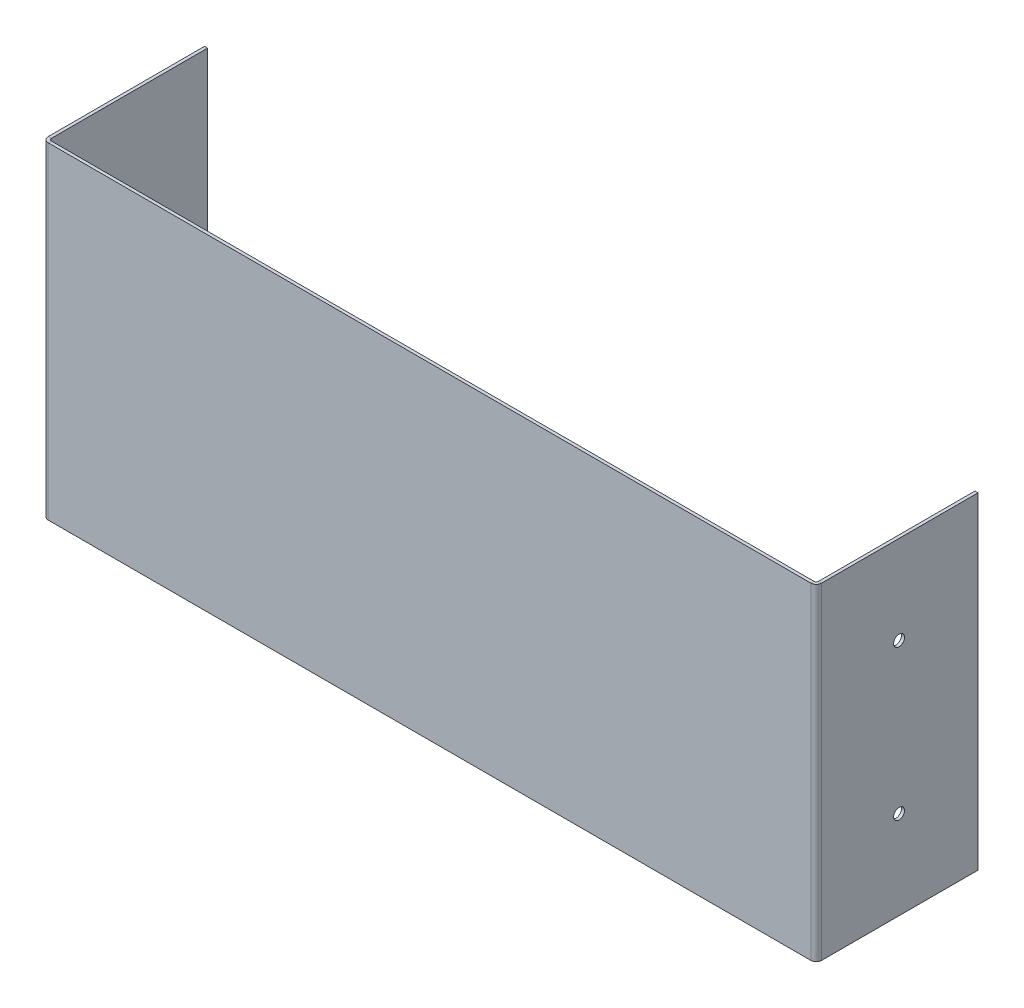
ISO-10303-21;
HEADER;
FILE_DESCRIPTION(('STEP AP214'),'2;1');
FILE_NAME('part.step','',(''),(''),'','','');
FILE_SCHEMA(('AUTOMOTIVE_DESIGN { 1 0 10303 214 1 1 1 1 }'));
ENDSEC;
DATA;
#1=APPLICATION_CONTEXT('core data for automotive mechanical design processes');
#2=APPLICATION_PROTOCOL_DEFINITION('international standard','automotive_design',2000,#1);
#3=PRODUCT_CONTEXT('',#1,'mechanical');
#4=PRODUCT('Part','Part','',(#3));
#5=PRODUCT_RELATED_PRODUCT_CATEGORY('part','',(#4));
#6=PRODUCT_DEFINITION_FORMATION('','',#4);
#7=PRODUCT_DEFINITION_CONTEXT('part definition',#1,'design');
#8=PRODUCT_DEFINITION('design','',#6,#7);
#9=PRODUCT_DEFINITION_SHAPE('','',#8);
#10=(LENGTH_UNIT() NAMED_UNIT(*) SI_UNIT(.MILLI.,.METRE.));
#11=(NAMED_UNIT(*) PLANE_ANGLE_UNIT() SI_UNIT($,.RADIAN.));
#12=(NAMED_UNIT(*) SI_UNIT($,.STERADIAN.) SOLID_ANGLE_UNIT());
#13=UNCERTAINTY_MEASURE_WITH_UNIT(LENGTH_MEASURE(1.E-05),#10,'distance_accuracy_value','');
#14=(GEOMETRIC_REPRESENTATION_CONTEXT(3) GLOBAL_UNCERTAINTY_ASSIGNED_CONTEXT((#13)) GLOBAL_UNIT_ASSIGNED_CONTEXT((#10,
#11,#12)) REPRESENTATION_CONTEXT('',''));
#15=CARTESIAN_POINT('',(0.,0.,0.));
#16=DIRECTION('',(0.,0.,1.));
#17=DIRECTION('',(1.,0.,0.));
#18=AXIS2_PLACEMENT_3D('',#15,#16,#17);
#19=CARTESIAN_POINT('',(-124.4346,-52.578,-0.9906));
#20=DIRECTION('',(0.,0.,1.));
#21=DIRECTION('',(1.,0.,0.));
#22=AXIS2_PLACEMENT_3D('',#19,#20,#21);
#23=PLANE('',#22);
#24=DIRECTION('',(0.,-1.,0.));
#25=VECTOR('',#24,1.);
#26=CARTESIAN_POINT('',(122.7074,-52.578,-0.990600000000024));
#27=LINE('',#26,#25);
#28=CARTESIAN_POINT('',(122.7074,-52.578,-0.990600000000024));
#29=VERTEX_POINT('',#28);
#30=CARTESIAN_POINT('',(122.7074,52.578,-0.990600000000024));
#31=VERTEX_POINT('',#30);
#32=EDGE_CURVE('E217',#29,#31,#27,.F.);
#33=ORIENTED_EDGE('',*,*,#32,.F.);
#34=DIRECTION('',(1.,0.,0.));
#35=VECTOR('',#34,1.);
#36=CARTESIAN_POINT('',(-124.4346,-52.578,-0.9906));
#37=LINE('',#36,#35);
#38=CARTESIAN_POINT('',(-122.7074,-52.578,-0.990599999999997));
#39=VERTEX_POINT('',#38);
#40=EDGE_CURVE('E81',#39,#29,#37,.T.);
#41=ORIENTED_EDGE('',*,*,#40,.F.);
#42=DIRECTION('',(0.,1.,0.));
#43=VECTOR('',#42,1.);
#44=CARTESIAN_POINT('',(-122.7074,52.578,-0.990599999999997));
#45=LINE('',#44,#43);
#46=CARTESIAN_POINT('',(-122.7074,52.578,-0.990599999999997));
#47=VERTEX_POINT('',#46);
#48=EDGE_CURVE('E268',#47,#39,#45,.F.);
#49=ORIENTED_EDGE('',*,*,#48,.F.);
#50=DIRECTION('',(-1.,0.,0.));
#51=VECTOR('',#50,1.);
#52=CARTESIAN_POINT('',(-124.4346,52.578,-0.9906));
#53=LINE('',#52,#51);
#54=EDGE_CURVE('E13',#31,#47,#53,.T.);
#55=ORIENTED_EDGE('',*,*,#54,.F.);
#56=EDGE_LOOP('',(#33,#41,#49,#55));
#57=FACE_BOUND('',#56,.T.);
#58=ADVANCED_FACE('F72',(#57),#23,.F.);
#59=CARTESIAN_POINT('',(-124.4346,-52.578,0.));
#60=DIRECTION('',(0.,0.,1.));
#61=DIRECTION('',(1.,0.,0.));
#62=AXIS2_PLACEMENT_3D('',#59,#60,#61);
#63=PLANE('',#62);
#64=DIRECTION('',(1.,0.,0.));
#65=VECTOR('',#64,1.);
#66=CARTESIAN_POINT('',(-124.4346,-52.578,0.));
#67=LINE('',#66,#65);
#68=CARTESIAN_POINT('',(-122.7074,-52.578,0.));
#69=VERTEX_POINT('',#68);
#70=CARTESIAN_POINT('',(122.7074,-52.578,0.));
#71=VERTEX_POINT('',#70);
#72=EDGE_CURVE('E274',#69,#71,#67,.T.);
#73=ORIENTED_EDGE('',*,*,#72,.T.);
#74=DIRECTION('',(0.,-1.,0.));
#75=VECTOR('',#74,1.);
#76=CARTESIAN_POINT('',(122.7074,-52.578,0.));
#77=LINE('',#76,#75);
#78=CARTESIAN_POINT('',(122.7074,52.578,0.));
#79=VERTEX_POINT('',#78);
#80=EDGE_CURVE('E206',#71,#79,#77,.F.);
#81=ORIENTED_EDGE('',*,*,#80,.T.);
#82=DIRECTION('',(-1.,0.,0.));
#83=VECTOR('',#82,1.);
#84=CARTESIAN_POINT('',(-124.4346,52.578,0.));
#85=LINE('',#84,#83);
#86=CARTESIAN_POINT('',(-122.7074,52.578,0.));
#87=VERTEX_POINT('',#86);
#88=EDGE_CURVE('E76',#79,#87,#85,.T.);
#89=ORIENTED_EDGE('',*,*,#88,.T.);
#90=DIRECTION('',(0.,1.,0.));
#91=VECTOR('',#90,1.);
#92=CARTESIAN_POINT('',(-122.7074,52.578,0.));
#93=LINE('',#92,#91);
#94=EDGE_CURVE('E257',#87,#69,#93,.F.);
#95=ORIENTED_EDGE('',*,*,#94,.T.);
#96=EDGE_LOOP('',(#73,#81,#89,#95));
#97=FACE_BOUND('',#96,.T.);
#98=ADVANCED_FACE('F283',(#97),#63,.T.);
#99=CARTESIAN_POINT('',(-124.4346,-52.578,-0.9906));
#100=DIRECTION('',(0.,-1.,0.));
#101=DIRECTION('',(0.,0.,-1.));
#102=AXIS2_PLACEMENT_3D('',#99,#100,#101);
#103=PLANE('',#102);
#104=ORIENTED_EDGE('',*,*,#40,.T.);
#105=DIRECTION('',(0.,0.,1.));
#106=VECTOR('',#105,1.);
#107=CARTESIAN_POINT('',(122.7074,-52.578,-0.990600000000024));
#108=LINE('',#107,#106);
#109=EDGE_CURVE('E211',#29,#71,#108,.T.);
#110=ORIENTED_EDGE('',*,*,#109,.T.);
#111=ORIENTED_EDGE('',*,*,#72,.F.);
#112=DIRECTION('',(0.,0.,1.));
#113=VECTOR('',#112,1.);
#114=CARTESIAN_POINT('',(-122.7074,-52.578,-0.990599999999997));
#115=LINE('',#114,#113);
#116=EDGE_CURVE('E272',#39,#69,#115,.T.);
#117=ORIENTED_EDGE('',*,*,#116,.F.);
#118=EDGE_LOOP('',(#104,#110,#111,#117));
#119=FACE_BOUND('',#118,.T.);
#120=ADVANCED_FACE('F74',(#119),#103,.T.);
#121=CARTESIAN_POINT('',(-124.4346,52.578,-0.9906));
#122=DIRECTION('',(0.,1.,0.));
#123=DIRECTION('',(0.,0.,1.));
#124=AXIS2_PLACEMENT_3D('',#121,#122,#123);
#125=PLANE('',#124);
#126=DIRECTION('',(0.,0.,1.));
#127=VECTOR('',#126,1.);
#128=CARTESIAN_POINT('',(122.7074,52.578,-0.990600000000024));
#129=LINE('',#128,#127);
#130=EDGE_CURVE('E222',#31,#79,#129,.T.);
#131=ORIENTED_EDGE('',*,*,#130,.F.);
#132=ORIENTED_EDGE('',*,*,#54,.T.);
#133=DIRECTION('',(0.,0.,1.));
#134=VECTOR('',#133,1.);
#135=CARTESIAN_POINT('',(-122.7074,52.578,-0.990599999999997));
#136=LINE('',#135,#134);
#137=EDGE_CURVE('E262',#47,#87,#136,.T.);
#138=ORIENTED_EDGE('',*,*,#137,.T.);
#139=ORIENTED_EDGE('',*,*,#88,.F.);
#140=EDGE_LOOP('',(#131,#132,#138,#139));
#141=FACE_BOUND('',#140,.T.);
#142=ADVANCED_FACE('F286',(#141),#125,.T.);
#143=CARTESIAN_POINT('',(-122.7074,-52.578,-1.7272));
#144=DIRECTION('',(0.,-1.,0.));
#145=DIRECTION('',(0.,0.,-1.));
#146=AXIS2_PLACEMENT_3D('',#143,#144,#145);
#147=PLANE('',#146);
#148=DIRECTION('',(1.,0.,0.));
#149=VECTOR('',#148,1.);
#150=CARTESIAN_POINT('',(-124.4346,-52.578,-1.72719999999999));
#151=LINE('',#150,#149);
#152=CARTESIAN_POINT('',(-123.444,-52.578,-1.7272));
#153=VERTEX_POINT('',#152);
#154=CARTESIAN_POINT('',(-124.4346,-52.578,-1.72719999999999));
#155=VERTEX_POINT('',#154);
#156=EDGE_CURVE('E224',#153,#155,#151,.F.);
#157=ORIENTED_EDGE('',*,*,#156,.F.);
#158=CARTESIAN_POINT('',(-122.7074,-52.578,-1.7272));
#159=DIRECTION('',(0.,1.,0.));
#160=DIRECTION('',(0.,0.,1.));
#161=AXIS2_PLACEMENT_3D('',#158,#159,#160);
#162=CIRCLE('',#161,0.736600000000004);
#163=EDGE_CURVE('E265',#39,#153,#162,.F.);
#164=ORIENTED_EDGE('',*,*,#163,.F.);
#165=ORIENTED_EDGE('',*,*,#116,.T.);
#166=CARTESIAN_POINT('',(-122.7074,-52.578,-1.7272));
#167=DIRECTION('',(0.,1.,0.));
#168=DIRECTION('',(0.,0.,1.));
#169=AXIS2_PLACEMENT_3D('',#166,#167,#168);
#170=CIRCLE('',#169,1.7272);
#171=EDGE_CURVE('E89',#69,#155,#170,.F.);
#172=ORIENTED_EDGE('',*,*,#171,.T.);
#173=EDGE_LOOP('',(#157,#164,#165,#172));
#174=FACE_BOUND('',#173,.T.);
#175=ADVANCED_FACE('F318',(#174),#147,.T.);
#176=CARTESIAN_POINT('',(-122.7074,52.578,-1.7272));
#177=DIRECTION('',(0.,-1.,0.));
#178=DIRECTION('',(0.,0.,-1.));
#179=AXIS2_PLACEMENT_3D('',#176,#177,#178);
#180=PLANE('',#179);
#181=CARTESIAN_POINT('',(-122.7074,52.578,-1.7272));
#182=DIRECTION('',(0.,1.,0.));
#183=DIRECTION('',(0.,0.,1.));
#184=AXIS2_PLACEMENT_3D('',#181,#182,#183);
#185=CIRCLE('',#184,0.736600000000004);
#186=CARTESIAN_POINT('',(-123.444,52.578,-1.7272));
#187=VERTEX_POINT('',#186);
#188=EDGE_CURVE('E230',#187,#47,#185,.T.);
#189=ORIENTED_EDGE('',*,*,#188,.F.);
#190=DIRECTION('',(1.,0.,0.));
#191=VECTOR('',#190,1.);
#192=CARTESIAN_POINT('',(-123.444,52.578,-1.7272));
#193=LINE('',#192,#191);
#194=CARTESIAN_POINT('',(-124.4346,52.578,-1.72719999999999));
#195=VERTEX_POINT('',#194);
#196=EDGE_CURVE('E250',#187,#195,#193,.F.);
#197=ORIENTED_EDGE('',*,*,#196,.T.);
#198=CARTESIAN_POINT('',(-122.7074,52.578,-1.7272));
#199=DIRECTION('',(0.,1.,0.));
#200=DIRECTION('',(0.,0.,1.));
#201=AXIS2_PLACEMENT_3D('',#198,#199,#200);
#202=CIRCLE('',#201,1.7272);
#203=EDGE_CURVE('E260',#195,#87,#202,.T.);
#204=ORIENTED_EDGE('',*,*,#203,.T.);
#205=ORIENTED_EDGE('',*,*,#137,.F.);
#206=EDGE_LOOP('',(#189,#197,#204,#205));
#207=FACE_BOUND('',#206,.T.);
#208=ADVANCED_FACE('F291',(#207),#180,.F.);
#209=CARTESIAN_POINT('',(-122.7074,52.578,-1.7272));
#210=DIRECTION('',(0.,1.,0.));
#211=DIRECTION('',(-1.,0.,0.));
#212=AXIS2_PLACEMENT_3D('',#209,#210,#211);
#213=CYLINDRICAL_SURFACE('',#212,1.7272);
#214=ORIENTED_EDGE('',*,*,#94,.F.);
#215=ORIENTED_EDGE('',*,*,#203,.F.);
#216=DIRECTION('',(0.,1.,0.));
#217=VECTOR('',#216,1.);
#218=CARTESIAN_POINT('',(-124.4346,-52.578,-1.72719999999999));
#219=LINE('',#218,#217);
#220=EDGE_CURVE('E248',#195,#155,#219,.F.);
#221=ORIENTED_EDGE('',*,*,#220,.T.);
#222=ORIENTED_EDGE('',*,*,#171,.F.);
#223=EDGE_LOOP('',(#214,#215,#221,#222));
#224=FACE_BOUND('',#223,.T.);
#225=ADVANCED_FACE('F316',(#224),#213,.T.);
#226=CARTESIAN_POINT('',(-122.7074,52.578,-1.7272));
#227=DIRECTION('',(0.,1.,0.));
#228=DIRECTION('',(-1.,0.,0.));
#229=AXIS2_PLACEMENT_3D('',#226,#227,#228);
#230=CYLINDRICAL_SURFACE('',#229,0.736600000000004);
#231=ORIENTED_EDGE('',*,*,#48,.T.);
#232=ORIENTED_EDGE('',*,*,#163,.T.);
#233=DIRECTION('',(0.,1.,0.));
#234=VECTOR('',#233,1.);
#235=CARTESIAN_POINT('',(-123.444,-52.578,-1.7272));
#236=LINE('',#235,#234);
#237=EDGE_CURVE('E253',#153,#187,#236,.T.);
#238=ORIENTED_EDGE('',*,*,#237,.T.);
#239=ORIENTED_EDGE('',*,*,#188,.T.);
#240=EDGE_LOOP('',(#231,#232,#238,#239));
#241=FACE_BOUND('',#240,.T.);
#242=ADVANCED_FACE('F294',(#241),#230,.F.);
#243=CARTESIAN_POINT('',(-124.4346,52.578,-52.0446));
#244=DIRECTION('',(0.,-1.,0.));
#245=DIRECTION('',(0.,0.,-1.));
#246=AXIS2_PLACEMENT_3D('',#243,#244,#245);
#247=PLANE('',#246);
#248=ORIENTED_EDGE('',*,*,#196,.F.);
#249=DIRECTION('',(0.,0.,1.));
#250=VECTOR('',#249,1.);
#251=CARTESIAN_POINT('',(-123.444,52.578,-52.0446));
#252=LINE('',#251,#250);
#253=CARTESIAN_POINT('',(-123.444,52.578,-52.0446));
#254=VERTEX_POINT('',#253);
#255=EDGE_CURVE('E246',#187,#254,#252,.F.);
#256=ORIENTED_EDGE('',*,*,#255,.T.);
#257=DIRECTION('',(1.,0.,0.));
#258=VECTOR('',#257,1.);
#259=CARTESIAN_POINT('',(-124.4346,52.578,-52.0446));
#260=LINE('',#259,#258);
#261=CARTESIAN_POINT('',(-124.4346,52.578,-52.0446));
#262=VERTEX_POINT('',#261);
#263=EDGE_CURVE('E227',#262,#254,#260,.T.);
#264=ORIENTED_EDGE('',*,*,#263,.F.);
#265=DIRECTION('',(0.,0.,-1.));
#266=VECTOR('',#265,1.);
#267=CARTESIAN_POINT('',(-124.4346,52.578,-0.990599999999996));
#268=LINE('',#267,#266);
#269=EDGE_CURVE('E239',#195,#262,#268,.T.);
#270=ORIENTED_EDGE('',*,*,#269,.F.);
#271=EDGE_LOOP('',(#248,#256,#264,#270));
#272=FACE_BOUND('',#271,.T.);
#273=ADVANCED_FACE('F312',(#272),#247,.F.);
#274=CARTESIAN_POINT('',(-124.4346,-52.578,-0.990599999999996));
#275=DIRECTION('',(0.,1.,0.));
#276=DIRECTION('',(0.,0.,1.));
#277=AXIS2_PLACEMENT_3D('',#274,#275,#276);
#278=PLANE('',#277);
#279=ORIENTED_EDGE('',*,*,#156,.T.);
#280=DIRECTION('',(0.,0.,1.));
#281=VECTOR('',#280,1.);
#282=CARTESIAN_POINT('',(-124.4346,-52.578,-0.990599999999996));
#283=LINE('',#282,#281);
#284=CARTESIAN_POINT('',(-124.4346,-52.578,-52.0446));
#285=VERTEX_POINT('',#284);
#286=EDGE_CURVE('E234',#285,#155,#283,.T.);
#287=ORIENTED_EDGE('',*,*,#286,.F.);
#288=DIRECTION('',(1.,0.,0.));
#289=VECTOR('',#288,1.);
#290=CARTESIAN_POINT('',(-124.4346,-52.578,-52.0446));
#291=LINE('',#290,#289);
#292=CARTESIAN_POINT('',(-123.444,-52.578,-52.0446));
#293=VERTEX_POINT('',#292);
#294=EDGE_CURVE('E231',#285,#293,#291,.T.);
#295=ORIENTED_EDGE('',*,*,#294,.T.);
#296=DIRECTION('',(0.,0.,-1.));
#297=VECTOR('',#296,1.);
#298=CARTESIAN_POINT('',(-123.444,-52.578,-0.9906));
#299=LINE('',#298,#297);
#300=EDGE_CURVE('E241',#293,#153,#299,.F.);
#301=ORIENTED_EDGE('',*,*,#300,.T.);
#302=EDGE_LOOP('',(#279,#287,#295,#301));
#303=FACE_BOUND('',#302,.T.);
#304=ADVANCED_FACE('F303',(#303),#278,.F.);
#305=CARTESIAN_POINT('',(-124.4346,-52.578,-0.990599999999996));
#306=DIRECTION('',(1.,0.,0.));
#307=DIRECTION('',(0.,0.,-1.));
#308=AXIS2_PLACEMENT_3D('',#305,#306,#307);
#309=PLANE('',#308);
#310=CARTESIAN_POINT('',(-124.4346,24.13,-26.6445999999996));
#311=DIRECTION('',(-1.,0.,0.));
#312=DIRECTION('',(0.,0.,1.));
#313=AXIS2_PLACEMENT_3D('',#310,#311,#312);
#314=CIRCLE('',#313,1.75259999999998);
#315=CARTESIAN_POINT('',(-124.4346,24.13,-24.8919999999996));
#316=VERTEX_POINT('',#315);
#317=EDGE_CURVE('E604',#316,#316,#314,.T.);
#318=ORIENTED_EDGE('',*,*,#317,.F.);
#319=EDGE_LOOP('',(#318));
#320=FACE_BOUND('',#319,.T.);
#321=CARTESIAN_POINT('',(-124.4346,-24.13,-26.6445999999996));
#322=DIRECTION('',(-1.,0.,0.));
#323=DIRECTION('',(0.,0.,1.));
#324=AXIS2_PLACEMENT_3D('',#321,#322,#323);
#325=CIRCLE('',#324,1.7526);
#326=CARTESIAN_POINT('',(-124.4346,-24.13,-24.8919999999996));
#327=VERTEX_POINT('',#326);
#328=EDGE_CURVE('E610',#327,#327,#325,.T.);
#329=ORIENTED_EDGE('',*,*,#328,.F.);
#330=EDGE_LOOP('',(#329));
#331=FACE_BOUND('',#330,.T.);
#332=ORIENTED_EDGE('',*,*,#220,.F.);
#333=ORIENTED_EDGE('',*,*,#269,.T.);
#334=DIRECTION('',(0.,-1.,0.));
#335=VECTOR('',#334,1.);
#336=CARTESIAN_POINT('',(-124.4346,-52.578,-52.0446));
#337=LINE('',#336,#335);
#338=EDGE_CURVE('E237',#262,#285,#337,.T.);
#339=ORIENTED_EDGE('',*,*,#338,.T.);
#340=ORIENTED_EDGE('',*,*,#286,.T.);
#341=EDGE_LOOP('',(#332,#333,#339,#340));
#342=FACE_BOUND('',#341,.T.);
#343=ADVANCED_FACE('F315',(#320,#331,#342),#309,.F.);
#344=CARTESIAN_POINT('',(-123.444,-52.578,-0.9906));
#345=DIRECTION('',(1.,0.,0.));
#346=DIRECTION('',(0.,0.,-1.));
#347=AXIS2_PLACEMENT_3D('',#344,#345,#346);
#348=PLANE('',#347);
#349=CARTESIAN_POINT('',(-123.444,24.13,-26.6445999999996));
#350=DIRECTION('',(1.,0.,0.));
#351=DIRECTION('',(0.,0.,-1.));
#352=AXIS2_PLACEMENT_3D('',#349,#350,#351);
#353=CIRCLE('',#352,1.75259999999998);
#354=CARTESIAN_POINT('',(-123.444,24.13,-28.3971999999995));
#355=VERTEX_POINT('',#354);
#356=EDGE_CURVE('E607',#355,#355,#353,.F.);
#357=ORIENTED_EDGE('',*,*,#356,.T.);
#358=EDGE_LOOP('',(#357));
#359=FACE_BOUND('',#358,.T.);
#360=CARTESIAN_POINT('',(-123.444,-24.13,-26.6445999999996));
#361=DIRECTION('',(1.,0.,0.));
#362=DIRECTION('',(0.,0.,-1.));
#363=AXIS2_PLACEMENT_3D('',#360,#361,#362);
#364=CIRCLE('',#363,1.7526);
#365=CARTESIAN_POINT('',(-123.444,-24.13,-28.3971999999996));
#366=VERTEX_POINT('',#365);
#367=EDGE_CURVE('E205',#366,#366,#364,.F.);
#368=ORIENTED_EDGE('',*,*,#367,.T.);
#369=EDGE_LOOP('',(#368));
#370=FACE_BOUND('',#369,.T.);
#371=ORIENTED_EDGE('',*,*,#255,.F.);
#372=ORIENTED_EDGE('',*,*,#237,.F.);
#373=ORIENTED_EDGE('',*,*,#300,.F.);
#374=DIRECTION('',(0.,1.,0.));
#375=VECTOR('',#374,1.);
#376=CARTESIAN_POINT('',(-123.444,-52.578,-52.0446));
#377=LINE('',#376,#375);
#378=EDGE_CURVE('E244',#254,#293,#377,.F.);
#379=ORIENTED_EDGE('',*,*,#378,.F.);
#380=EDGE_LOOP('',(#371,#372,#373,#379));
#381=FACE_BOUND('',#380,.T.);
#382=ADVANCED_FACE('F300',(#359,#370,#381),#348,.T.);
#383=CARTESIAN_POINT('',(-124.4346,-52.578,-52.0446));
#384=DIRECTION('',(0.,0.,1.));
#385=DIRECTION('',(1.,0.,0.));
#386=AXIS2_PLACEMENT_3D('',#383,#384,#385);
#387=PLANE('',#386);
#388=ORIENTED_EDGE('',*,*,#378,.T.);
#389=ORIENTED_EDGE('',*,*,#294,.F.);
#390=ORIENTED_EDGE('',*,*,#338,.F.);
#391=ORIENTED_EDGE('',*,*,#263,.T.);
#392=EDGE_LOOP('',(#388,#389,#390,#391));
#393=FACE_BOUND('',#392,.T.);
#394=ADVANCED_FACE('F308',(#393),#387,.F.);
#395=CARTESIAN_POINT('',(122.7074,52.578,-1.72720000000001));
#396=DIRECTION('',(0.,1.,0.));
#397=DIRECTION('',(0.,0.,1.));
#398=AXIS2_PLACEMENT_3D('',#395,#396,#397);
#399=PLANE('',#398);
#400=DIRECTION('',(-1.,0.,0.));
#401=VECTOR('',#400,1.);
#402=CARTESIAN_POINT('',(124.4346,52.578,-1.72720000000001));
#403=LINE('',#402,#401);
#404=CARTESIAN_POINT('',(123.444,52.578,-1.72720000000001));
#405=VERTEX_POINT('',#404);
#406=CARTESIAN_POINT('',(124.4346,52.578,-1.72720000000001));
#407=VERTEX_POINT('',#406);
#408=EDGE_CURVE('E187',#405,#407,#403,.F.);
#409=ORIENTED_EDGE('',*,*,#408,.F.);
#410=CARTESIAN_POINT('',(122.7074,52.578,-1.72720000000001));
#411=DIRECTION('',(0.,-1.,0.));
#412=DIRECTION('',(0.,0.,-1.));
#413=AXIS2_PLACEMENT_3D('',#410,#411,#412);
#414=CIRCLE('',#413,0.73659999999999);
#415=EDGE_CURVE('E214',#31,#405,#414,.F.);
#416=ORIENTED_EDGE('',*,*,#415,.F.);
#417=ORIENTED_EDGE('',*,*,#130,.T.);
#418=CARTESIAN_POINT('',(122.7074,52.578,-1.72720000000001));
#419=DIRECTION('',(0.,-1.,0.));
#420=DIRECTION('',(0.,0.,-1.));
#421=AXIS2_PLACEMENT_3D('',#418,#419,#420);
#422=CIRCLE('',#421,1.72719999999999);
#423=EDGE_CURVE('E97',#79,#407,#422,.F.);
#424=ORIENTED_EDGE('',*,*,#423,.T.);
#425=EDGE_LOOP('',(#409,#416,#417,#424));
#426=FACE_BOUND('',#425,.T.);
#427=ADVANCED_FACE('F330',(#426),#399,.T.);
#428=CARTESIAN_POINT('',(122.7074,-52.578,-1.72720000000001));
#429=DIRECTION('',(0.,1.,0.));
#430=DIRECTION('',(0.,0.,1.));
#431=AXIS2_PLACEMENT_3D('',#428,#429,#430);
#432=PLANE('',#431);
#433=CARTESIAN_POINT('',(122.7074,-52.578,-1.72720000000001));
#434=DIRECTION('',(0.,-1.,0.));
#435=DIRECTION('',(0.,0.,-1.));
#436=AXIS2_PLACEMENT_3D('',#433,#434,#435);
#437=CIRCLE('',#436,0.73659999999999);
#438=CARTESIAN_POINT('',(123.444,-52.578,-1.72720000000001));
#439=VERTEX_POINT('',#438);
#440=EDGE_CURVE('E219',#439,#29,#437,.T.);
#441=ORIENTED_EDGE('',*,*,#440,.F.);
#442=DIRECTION('',(-1.,0.,0.));
#443=VECTOR('',#442,1.);
#444=CARTESIAN_POINT('',(123.444,-52.578,-1.72720000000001));
#445=LINE('',#444,#443);
#446=CARTESIAN_POINT('',(124.4346,-52.578,-1.72720000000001));
#447=VERTEX_POINT('',#446);
#448=EDGE_CURVE('E199',#439,#447,#445,.F.);
#449=ORIENTED_EDGE('',*,*,#448,.T.);
#450=CARTESIAN_POINT('',(122.7074,-52.578,-1.72720000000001));
#451=DIRECTION('',(0.,-1.,0.));
#452=DIRECTION('',(0.,0.,-1.));
#453=AXIS2_PLACEMENT_3D('',#450,#451,#452);
#454=CIRCLE('',#453,1.72719999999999);
#455=EDGE_CURVE('E209',#447,#71,#454,.T.);
#456=ORIENTED_EDGE('',*,*,#455,.T.);
#457=ORIENTED_EDGE('',*,*,#109,.F.);
#458=EDGE_LOOP('',(#441,#449,#456,#457));
#459=FACE_BOUND('',#458,.T.);
#460=ADVANCED_FACE('F332',(#459),#432,.F.);
#461=CARTESIAN_POINT('',(122.7074,-52.578,-1.72720000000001));
#462=DIRECTION('',(0.,-1.,0.));
#463=DIRECTION('',(1.,0.,0.));
#464=AXIS2_PLACEMENT_3D('',#461,#462,#463);
#465=CYLINDRICAL_SURFACE('',#464,1.72719999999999);
#466=ORIENTED_EDGE('',*,*,#80,.F.);
#467=ORIENTED_EDGE('',*,*,#455,.F.);
#468=DIRECTION('',(0.,-1.,0.));
#469=VECTOR('',#468,1.);
#470=CARTESIAN_POINT('',(124.4346,52.578,-1.72720000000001));
#471=LINE('',#470,#469);
#472=EDGE_CURVE('E197',#447,#407,#471,.F.);
#473=ORIENTED_EDGE('',*,*,#472,.T.);
#474=ORIENTED_EDGE('',*,*,#423,.F.);
#475=EDGE_LOOP('',(#466,#467,#473,#474));
#476=FACE_BOUND('',#475,.T.);
#477=ADVANCED_FACE('F334',(#476),#465,.T.);
#478=CARTESIAN_POINT('',(122.7074,-52.578,-1.72720000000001));
#479=DIRECTION('',(0.,-1.,0.));
#480=DIRECTION('',(1.,0.,0.));
#481=AXIS2_PLACEMENT_3D('',#478,#479,#480);
#482=CYLINDRICAL_SURFACE('',#481,0.73659999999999);
#483=ORIENTED_EDGE('',*,*,#32,.T.);
#484=ORIENTED_EDGE('',*,*,#415,.T.);
#485=DIRECTION('',(0.,-1.,0.));
#486=VECTOR('',#485,1.);
#487=CARTESIAN_POINT('',(123.444,52.578,-1.72720000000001));
#488=LINE('',#487,#486);
#489=EDGE_CURVE('E202',#405,#439,#488,.T.);
#490=ORIENTED_EDGE('',*,*,#489,.T.);
#491=ORIENTED_EDGE('',*,*,#440,.T.);
#492=EDGE_LOOP('',(#483,#484,#490,#491));
#493=FACE_BOUND('',#492,.T.);
#494=ADVANCED_FACE('F326',(#493),#482,.F.);
#495=CARTESIAN_POINT('',(124.4346,-52.578,-52.0446));
#496=DIRECTION('',(0.,1.,0.));
#497=DIRECTION('',(0.,0.,1.));
#498=AXIS2_PLACEMENT_3D('',#495,#496,#497);
#499=PLANE('',#498);
#500=ORIENTED_EDGE('',*,*,#448,.F.);
#501=DIRECTION('',(0.,0.,1.));
#502=VECTOR('',#501,1.);
#503=CARTESIAN_POINT('',(123.444,-52.578,-52.0446));
#504=LINE('',#503,#502);
#505=CARTESIAN_POINT('',(123.444,-52.578,-52.0446));
#506=VERTEX_POINT('',#505);
#507=EDGE_CURVE('E195',#439,#506,#504,.F.);
#508=ORIENTED_EDGE('',*,*,#507,.T.);
#509=DIRECTION('',(-1.,0.,0.));
#510=VECTOR('',#509,1.);
#511=CARTESIAN_POINT('',(124.4346,-52.578,-52.0446));
#512=LINE('',#511,#510);
#513=CARTESIAN_POINT('',(124.4346,-52.578,-52.0446));
#514=VERTEX_POINT('',#513);
#515=EDGE_CURVE('E183',#514,#506,#512,.T.);
#516=ORIENTED_EDGE('',*,*,#515,.F.);
#517=DIRECTION('',(0.,0.,-1.));
#518=VECTOR('',#517,1.);
#519=CARTESIAN_POINT('',(124.4346,-52.578,-0.990599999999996));
#520=LINE('',#519,#518);
#521=EDGE_CURVE('E170',#447,#514,#520,.T.);
#522=ORIENTED_EDGE('',*,*,#521,.F.);
#523=EDGE_LOOP('',(#500,#508,#516,#522));
#524=FACE_BOUND('',#523,.T.);
#525=ADVANCED_FACE('F483',(#524),#499,.F.);
#526=CARTESIAN_POINT('',(124.4346,52.578,-0.990599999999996));
#527=DIRECTION('',(0.,-1.,0.));
#528=DIRECTION('',(0.,0.,-1.));
#529=AXIS2_PLACEMENT_3D('',#526,#527,#528);
#530=PLANE('',#529);
#531=ORIENTED_EDGE('',*,*,#408,.T.);
#532=DIRECTION('',(0.,0.,1.));
#533=VECTOR('',#532,1.);
#534=CARTESIAN_POINT('',(124.4346,52.578,-0.990599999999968));
#535=LINE('',#534,#533);
#536=CARTESIAN_POINT('',(124.4346,52.578,-52.0446));
#537=VERTEX_POINT('',#536);
#538=EDGE_CURVE('E168',#537,#407,#535,.T.);
#539=ORIENTED_EDGE('',*,*,#538,.F.);
#540=DIRECTION('',(-1.,0.,0.));
#541=VECTOR('',#540,1.);
#542=CARTESIAN_POINT('',(124.4346,52.578,-52.0446));
#543=LINE('',#542,#541);
#544=CARTESIAN_POINT('',(123.444,52.578,-52.0446));
#545=VERTEX_POINT('',#544);
#546=EDGE_CURVE('E176',#537,#545,#543,.T.);
#547=ORIENTED_EDGE('',*,*,#546,.T.);
#548=DIRECTION('',(0.,0.,-1.));
#549=VECTOR('',#548,1.);
#550=CARTESIAN_POINT('',(123.444,52.578,-0.9906));
#551=LINE('',#550,#549);
#552=EDGE_CURVE('E192',#545,#405,#551,.F.);
#553=ORIENTED_EDGE('',*,*,#552,.T.);
#554=EDGE_LOOP('',(#531,#539,#547,#553));
#555=FACE_BOUND('',#554,.T.);
#556=ADVANCED_FACE('F186',(#555),#530,.F.);
#557=CARTESIAN_POINT('',(124.4346,-52.578,-0.990599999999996));
#558=DIRECTION('',(-1.,0.,0.));
#559=DIRECTION('',(0.,0.,1.));
#560=AXIS2_PLACEMENT_3D('',#557,#558,#559);
#561=PLANE('',#560);
#562=CARTESIAN_POINT('',(124.4346,-24.13,-26.6445999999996));
#563=DIRECTION('',(1.,0.,0.));
#564=DIRECTION('',(0.,0.,-1.));
#565=AXIS2_PLACEMENT_3D('',#562,#563,#564);
#566=CIRCLE('',#565,1.7526);
#567=CARTESIAN_POINT('',(124.4346,-24.13,-28.3971999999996));
#568=VERTEX_POINT('',#567);
#569=EDGE_CURVE('E591',#568,#568,#566,.T.);
#570=ORIENTED_EDGE('',*,*,#569,.F.);
#571=EDGE_LOOP('',(#570));
#572=FACE_BOUND('',#571,.T.);
#573=CARTESIAN_POINT('',(124.4346,24.13,-26.6445999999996));
#574=DIRECTION('',(1.,0.,0.));
#575=DIRECTION('',(0.,0.,-1.));
#576=AXIS2_PLACEMENT_3D('',#573,#574,#575);
#577=CIRCLE('',#576,1.7526);
#578=CARTESIAN_POINT('',(124.4346,24.13,-28.3971999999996));
#579=VERTEX_POINT('',#578);
#580=EDGE_CURVE('E595',#579,#579,#577,.T.);
#581=ORIENTED_EDGE('',*,*,#580,.F.);
#582=EDGE_LOOP('',(#581));
#583=FACE_BOUND('',#582,.T.);
#584=ORIENTED_EDGE('',*,*,#472,.F.);
#585=ORIENTED_EDGE('',*,*,#521,.T.);
#586=DIRECTION('',(0.,1.,0.));
#587=VECTOR('',#586,1.);
#588=CARTESIAN_POINT('',(124.4346,-52.578,-52.0446));
#589=LINE('',#588,#587);
#590=EDGE_CURVE('E163',#514,#537,#589,.T.);
#591=ORIENTED_EDGE('',*,*,#590,.T.);
#592=ORIENTED_EDGE('',*,*,#538,.T.);
#593=EDGE_LOOP('',(#584,#585,#591,#592));
#594=FACE_BOUND('',#593,.T.);
#595=ADVANCED_FACE('F166',(#572,#583,#594),#561,.F.);
#596=CARTESIAN_POINT('',(123.444,-52.578,-0.9906));
#597=DIRECTION('',(-1.,0.,0.));
#598=DIRECTION('',(0.,0.,1.));
#599=AXIS2_PLACEMENT_3D('',#596,#597,#598);
#600=PLANE('',#599);
#601=CARTESIAN_POINT('',(123.444,-24.13,-26.6445999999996));
#602=DIRECTION('',(-1.,0.,0.));
#603=DIRECTION('',(0.,0.,1.));
#604=AXIS2_PLACEMENT_3D('',#601,#602,#603);
#605=CIRCLE('',#604,1.7526);
#606=CARTESIAN_POINT('',(123.444,-24.13,-24.8919999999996));
#607=VERTEX_POINT('',#606);
#608=EDGE_CURVE('E594',#607,#607,#605,.F.);
#609=ORIENTED_EDGE('',*,*,#608,.T.);
#610=EDGE_LOOP('',(#609));
#611=FACE_BOUND('',#610,.T.);
#612=CARTESIAN_POINT('',(123.444,24.13,-26.6445999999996));
#613=DIRECTION('',(-1.,0.,0.));
#614=DIRECTION('',(0.,0.,1.));
#615=AXIS2_PLACEMENT_3D('',#612,#613,#614);
#616=CIRCLE('',#615,1.7526);
#617=CARTESIAN_POINT('',(123.444,24.13,-24.8919999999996));
#618=VERTEX_POINT('',#617);
#619=EDGE_CURVE('E598',#618,#618,#616,.F.);
#620=ORIENTED_EDGE('',*,*,#619,.T.);
#621=EDGE_LOOP('',(#620));
#622=FACE_BOUND('',#621,.T.);
#623=ORIENTED_EDGE('',*,*,#507,.F.);
#624=ORIENTED_EDGE('',*,*,#489,.F.);
#625=ORIENTED_EDGE('',*,*,#552,.F.);
#626=DIRECTION('',(0.,-1.,0.));
#627=VECTOR('',#626,1.);
#628=CARTESIAN_POINT('',(123.444,52.578,-52.0446));
#629=LINE('',#628,#627);
#630=EDGE_CURVE('E179',#506,#545,#629,.F.);
#631=ORIENTED_EDGE('',*,*,#630,.F.);
#632=EDGE_LOOP('',(#623,#624,#625,#631));
#633=FACE_BOUND('',#632,.T.);
#634=ADVANCED_FACE('F511',(#611,#622,#633),#600,.T.);
#635=CARTESIAN_POINT('',(124.4346,52.578,-52.0446));
#636=DIRECTION('',(0.,0.,1.));
#637=DIRECTION('',(1.,0.,0.));
#638=AXIS2_PLACEMENT_3D('',#635,#636,#637);
#639=PLANE('',#638);
#640=ORIENTED_EDGE('',*,*,#630,.T.);
#641=ORIENTED_EDGE('',*,*,#546,.F.);
#642=ORIENTED_EDGE('',*,*,#590,.F.);
#643=ORIENTED_EDGE('',*,*,#515,.T.);
#644=EDGE_LOOP('',(#640,#641,#642,#643));
#645=FACE_BOUND('',#644,.T.);
#646=ADVANCED_FACE('F177',(#645),#639,.F.);
#647=CARTESIAN_POINT('',(-118.48689862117,-24.13,-26.6445999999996));
#648=DIRECTION('',(-1.,0.,0.));
#649=DIRECTION('',(0.,0.,1.));
#650=AXIS2_PLACEMENT_3D('',#647,#648,#649);
#651=CYLINDRICAL_SURFACE('',#650,1.7526);
#652=ORIENTED_EDGE('',*,*,#328,.T.);
#653=EDGE_LOOP('',(#652));
#654=FACE_BOUND('',#653,.T.);
#655=ORIENTED_EDGE('',*,*,#367,.F.);
#656=EDGE_LOOP('',(#655));
#657=FACE_BOUND('',#656,.T.);
#658=ADVANCED_FACE('F533',(#654,#657),#651,.F.);
#659=CARTESIAN_POINT('',(-118.48689862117,24.13,-26.6445999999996));
#660=DIRECTION('',(-1.,0.,0.));
#661=DIRECTION('',(0.,0.,1.));
#662=AXIS2_PLACEMENT_3D('',#659,#660,#661);
#663=CYLINDRICAL_SURFACE('',#662,1.75259999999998);
#664=ORIENTED_EDGE('',*,*,#317,.T.);
#665=EDGE_LOOP('',(#664));
#666=FACE_BOUND('',#665,.T.);
#667=ORIENTED_EDGE('',*,*,#356,.F.);
#668=EDGE_LOOP('',(#667));
#669=FACE_BOUND('',#668,.T.);
#670=ADVANCED_FACE('F542',(#666,#669),#663,.F.);
#671=CARTESIAN_POINT('',(118.48689862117,24.13,-26.6445999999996));
#672=DIRECTION('',(1.,0.,0.));
#673=DIRECTION('',(0.,0.,-1.));
#674=AXIS2_PLACEMENT_3D('',#671,#672,#673);
#675=CYLINDRICAL_SURFACE('',#674,1.7526);
#676=ORIENTED_EDGE('',*,*,#580,.T.);
#677=EDGE_LOOP('',(#676));
#678=FACE_BOUND('',#677,.T.);
#679=ORIENTED_EDGE('',*,*,#619,.F.);
#680=EDGE_LOOP('',(#679));
#681=FACE_BOUND('',#680,.T.);
#682=ADVANCED_FACE('F552',(#678,#681),#675,.F.);
#683=CARTESIAN_POINT('',(118.48689862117,-24.13,-26.6445999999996));
#684=DIRECTION('',(1.,0.,0.));
#685=DIRECTION('',(0.,0.,-1.));
#686=AXIS2_PLACEMENT_3D('',#683,#684,#685);
#687=CYLINDRICAL_SURFACE('',#686,1.7526);
#688=ORIENTED_EDGE('',*,*,#569,.T.);
#689=EDGE_LOOP('',(#688));
#690=FACE_BOUND('',#689,.T.);
#691=ORIENTED_EDGE('',*,*,#608,.F.);
#692=EDGE_LOOP('',(#691));
#693=FACE_BOUND('',#692,.T.);
#694=ADVANCED_FACE('F562',(#690,#693),#687,.F.);
#695=CLOSED_SHELL('',(#58,#98,#120,#142,#175,#208,#225,#242,#273,#304,#343,#382,#394,#427,#460,
#477,#494,#525,#556,#595,#634,#646,#658,#670,#682,#694));
#696=MANIFOLD_SOLID_BREP('B2',#695);
#697=ADVANCED_BREP_SHAPE_REPRESENTATION('',(#18,#696),#14);
#698=SHAPE_DEFINITION_REPRESENTATION(#9,#697);
ENDSEC;
END-ISO-10303-21;
